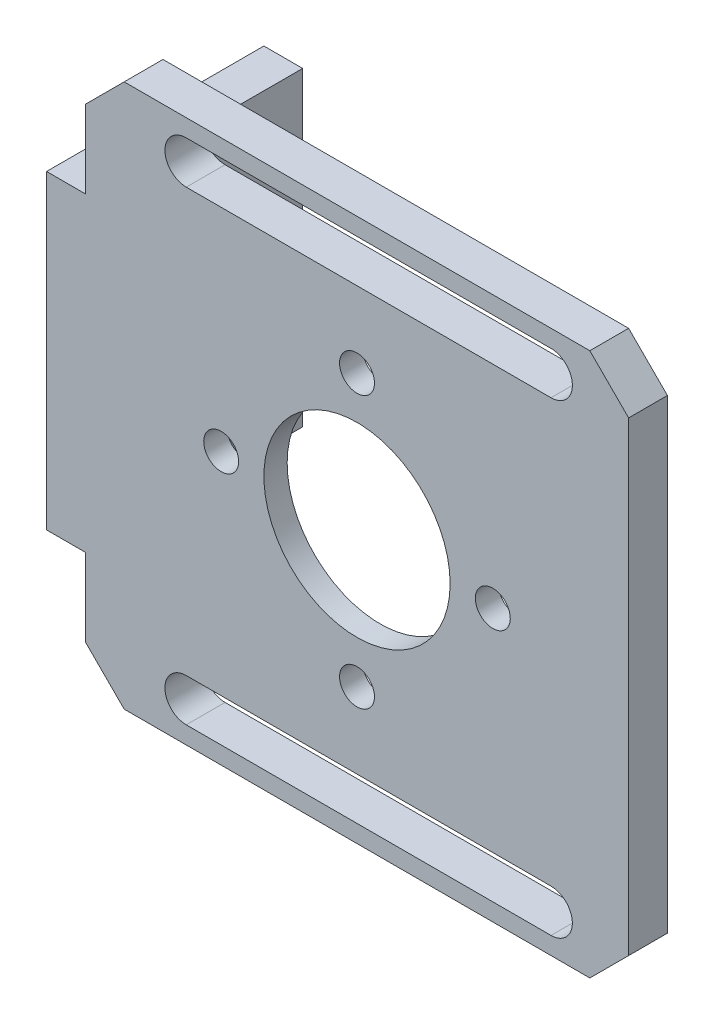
ISO-10303-21;
HEADER;
FILE_DESCRIPTION(('STEP AP214'),'2;1');
FILE_NAME('part.step','',(''),(''),'','','');
FILE_SCHEMA(('AUTOMOTIVE_DESIGN { 1 0 10303 214 1 1 1 1 }'));
ENDSEC;
DATA;
#1=APPLICATION_CONTEXT('core data for automotive mechanical design processes');
#2=APPLICATION_PROTOCOL_DEFINITION('international standard','automotive_design',2000,#1);
#3=PRODUCT_CONTEXT('',#1,'mechanical');
#4=PRODUCT('Part','Part','',(#3));
#5=PRODUCT_RELATED_PRODUCT_CATEGORY('part','',(#4));
#6=PRODUCT_DEFINITION_FORMATION('','',#4);
#7=PRODUCT_DEFINITION_CONTEXT('part definition',#1,'design');
#8=PRODUCT_DEFINITION('design','',#6,#7);
#9=PRODUCT_DEFINITION_SHAPE('','',#8);
#10=(LENGTH_UNIT() NAMED_UNIT(*) SI_UNIT(.MILLI.,.METRE.));
#11=(NAMED_UNIT(*) PLANE_ANGLE_UNIT() SI_UNIT($,.RADIAN.));
#12=(NAMED_UNIT(*) SI_UNIT($,.STERADIAN.) SOLID_ANGLE_UNIT());
#13=UNCERTAINTY_MEASURE_WITH_UNIT(LENGTH_MEASURE(1.E-05),#10,'distance_accuracy_value','');
#14=(GEOMETRIC_REPRESENTATION_CONTEXT(3) GLOBAL_UNCERTAINTY_ASSIGNED_CONTEXT((#13)) GLOBAL_UNIT_ASSIGNED_CONTEXT((#10,
#11,#12)) REPRESENTATION_CONTEXT('',''));
#15=CARTESIAN_POINT('',(0.,0.,0.));
#16=DIRECTION('',(0.,0.,1.));
#17=DIRECTION('',(1.,0.,0.));
#18=AXIS2_PLACEMENT_3D('',#15,#16,#17);
#19=CARTESIAN_POINT('',(0.,0.,-23.));
#20=DIRECTION('',(0.,0.,1.));
#21=DIRECTION('',(1.,0.,0.));
#22=AXIS2_PLACEMENT_3D('',#19,#20,#21);
#23=CYLINDRICAL_SURFACE('',#22,12.);
#24=CARTESIAN_POINT('',(0.,0.,5.));
#25=DIRECTION('',(0.,0.,1.));
#26=DIRECTION('',(1.,0.,0.));
#27=AXIS2_PLACEMENT_3D('',#24,#25,#26);
#28=CIRCLE('',#27,12.);
#29=CARTESIAN_POINT('',(12.,0.,5.));
#30=VERTEX_POINT('',#29);
#31=EDGE_CURVE('E221',#30,#30,#28,.T.);
#32=ORIENTED_EDGE('',*,*,#31,.T.);
#33=EDGE_LOOP('',(#32));
#34=FACE_BOUND('',#33,.T.);
#35=CARTESIAN_POINT('',(0.,0.,2.));
#36=DIRECTION('',(0.,0.,-1.));
#37=DIRECTION('',(-1.,0.,0.));
#38=AXIS2_PLACEMENT_3D('',#35,#36,#37);
#39=CIRCLE('',#38,12.);
#40=CARTESIAN_POINT('',(-12.,0.,2.));
#41=VERTEX_POINT('',#40);
#42=EDGE_CURVE('E218',#41,#41,#39,.F.);
#43=ORIENTED_EDGE('',*,*,#42,.F.);
#44=EDGE_LOOP('',(#43));
#45=FACE_BOUND('',#44,.T.);
#46=ADVANCED_FACE('F33',(#34,#45),#23,.F.);
#47=CARTESIAN_POINT('',(-35.,35.,5.));
#48=DIRECTION('',(1.,0.,0.));
#49=DIRECTION('',(0.,0.,-1.));
#50=AXIS2_PLACEMENT_3D('',#47,#48,#49);
#51=PLANE('',#50);
#52=DIRECTION('',(0.,0.,1.));
#53=VECTOR('',#52,1.);
#54=CARTESIAN_POINT('',(-35.,-20.,-23.));
#55=LINE('',#54,#53);
#56=CARTESIAN_POINT('',(-35.,-20.,0.));
#57=VERTEX_POINT('',#56);
#58=CARTESIAN_POINT('',(-35.,-20.,5.));
#59=VERTEX_POINT('',#58);
#60=EDGE_CURVE('E42',#57,#59,#55,.T.);
#61=ORIENTED_EDGE('',*,*,#60,.F.);
#62=DIRECTION('',(0.,-1.,0.));
#63=VECTOR('',#62,1.);
#64=CARTESIAN_POINT('',(-35.,35.,0.));
#65=LINE('',#64,#63);
#66=CARTESIAN_POINT('',(-35.,-30.,0.));
#67=VERTEX_POINT('',#66);
#68=EDGE_CURVE('E345',#57,#67,#65,.T.);
#69=ORIENTED_EDGE('',*,*,#68,.T.);
#70=DIRECTION('',(0.,0.,1.));
#71=VECTOR('',#70,1.);
#72=CARTESIAN_POINT('',(-35.,-30.,5.));
#73=LINE('',#72,#71);
#74=CARTESIAN_POINT('',(-35.,-30.,5.));
#75=VERTEX_POINT('',#74);
#76=EDGE_CURVE('E178',#67,#75,#73,.T.);
#77=ORIENTED_EDGE('',*,*,#76,.T.);
#78=DIRECTION('',(0.,-1.,0.));
#79=VECTOR('',#78,1.);
#80=CARTESIAN_POINT('',(-35.,35.,5.));
#81=LINE('',#80,#79);
#82=EDGE_CURVE('E175',#59,#75,#81,.T.);
#83=ORIENTED_EDGE('',*,*,#82,.F.);
#84=EDGE_LOOP('',(#61,#69,#77,#83));
#85=FACE_BOUND('',#84,.T.);
#86=ADVANCED_FACE('F176',(#85),#51,.F.);
#87=CARTESIAN_POINT('',(-35.,-35.,5.));
#88=DIRECTION('',(0.,0.,1.));
#89=DIRECTION('',(1.,0.,0.));
#90=AXIS2_PLACEMENT_3D('',#87,#88,#89);
#91=PLANE('',#90);
#92=CARTESIAN_POINT('',(-17.5,-1.83302876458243E-13,5.));
#93=DIRECTION('',(0.,0.,1.));
#94=DIRECTION('',(0.,-1.,0.));
#95=AXIS2_PLACEMENT_3D('',#92,#93,#94);
#96=CIRCLE('',#95,2.25);
#97=CARTESIAN_POINT('',(-17.5,-2.25000000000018,5.));
#98=VERTEX_POINT('',#97);
#99=EDGE_CURVE('E243',#98,#98,#96,.T.);
#100=ORIENTED_EDGE('',*,*,#99,.F.);
#101=EDGE_LOOP('',(#100));
#102=FACE_BOUND('',#101,.T.);
#103=CARTESIAN_POINT('',(-1.22201917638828E-13,17.5,5.));
#104=DIRECTION('',(0.,0.,1.));
#105=DIRECTION('',(-1.,0.,0.));
#106=AXIS2_PLACEMENT_3D('',#103,#104,#105);
#107=CIRCLE('',#106,2.25);
#108=CARTESIAN_POINT('',(-2.25000000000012,17.5,5.));
#109=VERTEX_POINT('',#108);
#110=EDGE_CURVE('E233',#109,#109,#107,.T.);
#111=ORIENTED_EDGE('',*,*,#110,.F.);
#112=EDGE_LOOP('',(#111));
#113=FACE_BOUND('',#112,.T.);
#114=CARTESIAN_POINT('',(17.5,0.,5.));
#115=DIRECTION('',(0.,0.,1.));
#116=DIRECTION('',(0.,1.,0.));
#117=AXIS2_PLACEMENT_3D('',#114,#115,#116);
#118=CIRCLE('',#117,2.25);
#119=CARTESIAN_POINT('',(17.5,2.25000000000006,5.));
#120=VERTEX_POINT('',#119);
#121=EDGE_CURVE('E230',#120,#120,#118,.T.);
#122=ORIENTED_EDGE('',*,*,#121,.F.);
#123=EDGE_LOOP('',(#122));
#124=FACE_BOUND('',#123,.T.);
#125=CARTESIAN_POINT('',(0.,-17.5,5.));
#126=DIRECTION('',(0.,0.,1.));
#127=DIRECTION('',(1.,0.,0.));
#128=AXIS2_PLACEMENT_3D('',#125,#126,#127);
#129=CIRCLE('',#128,2.25);
#130=CARTESIAN_POINT('',(2.25,-17.5,5.));
#131=VERTEX_POINT('',#130);
#132=EDGE_CURVE('E227',#131,#131,#129,.T.);
#133=ORIENTED_EDGE('',*,*,#132,.F.);
#134=EDGE_LOOP('',(#133));
#135=FACE_BOUND('',#134,.T.);
#136=ORIENTED_EDGE('',*,*,#31,.F.);
#137=EDGE_LOOP('',(#136));
#138=FACE_BOUND('',#137,.T.);
#139=DIRECTION('',(1.,0.,0.));
#140=VECTOR('',#139,1.);
#141=CARTESIAN_POINT('',(-22.,27.25,5.));
#142=LINE('',#141,#140);
#143=CARTESIAN_POINT('',(-22.,27.25,5.));
#144=VERTEX_POINT('',#143);
#145=CARTESIAN_POINT('',(25.,27.25,5.));
#146=VERTEX_POINT('',#145);
#147=EDGE_CURVE('E361',#144,#146,#142,.T.);
#148=ORIENTED_EDGE('',*,*,#147,.F.);
#149=CARTESIAN_POINT('',(-22.,30.,5.));
#150=DIRECTION('',(0.,0.,1.));
#151=DIRECTION('',(1.,0.,0.));
#152=AXIS2_PLACEMENT_3D('',#149,#150,#151);
#153=CIRCLE('',#152,2.75);
#154=CARTESIAN_POINT('',(-22.,32.75,5.));
#155=VERTEX_POINT('',#154);
#156=EDGE_CURVE('E363',#155,#144,#153,.T.);
#157=ORIENTED_EDGE('',*,*,#156,.F.);
#158=DIRECTION('',(-1.,0.,0.));
#159=VECTOR('',#158,1.);
#160=CARTESIAN_POINT('',(-22.,32.75,5.));
#161=LINE('',#160,#159);
#162=CARTESIAN_POINT('',(25.,32.75,5.));
#163=VERTEX_POINT('',#162);
#164=EDGE_CURVE('E356',#163,#155,#161,.T.);
#165=ORIENTED_EDGE('',*,*,#164,.F.);
#166=CARTESIAN_POINT('',(25.,30.,5.));
#167=DIRECTION('',(0.,0.,1.));
#168=DIRECTION('',(-1.,0.,0.));
#169=AXIS2_PLACEMENT_3D('',#166,#167,#168);
#170=CIRCLE('',#169,2.75);
#171=EDGE_CURVE('E358',#146,#163,#170,.T.);
#172=ORIENTED_EDGE('',*,*,#171,.F.);
#173=EDGE_LOOP('',(#148,#157,#165,#172));
#174=FACE_BOUND('',#173,.T.);
#175=DIRECTION('',(-1.,0.,0.));
#176=VECTOR('',#175,1.);
#177=CARTESIAN_POINT('',(-35.,35.,5.));
#178=LINE('',#177,#176);
#179=CARTESIAN_POINT('',(30.,35.,5.));
#180=VERTEX_POINT('',#179);
#181=CARTESIAN_POINT('',(-30.,35.,5.));
#182=VERTEX_POINT('',#181);
#183=EDGE_CURVE('E289',#180,#182,#178,.T.);
#184=ORIENTED_EDGE('',*,*,#183,.T.);
#185=DIRECTION('',(0.70710678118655,0.707106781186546,0.));
#186=VECTOR('',#185,1.);
#187=CARTESIAN_POINT('',(-67.5,-2.49999999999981,5.));
#188=LINE('',#187,#186);
#189=CARTESIAN_POINT('',(-35.,30.,5.));
#190=VERTEX_POINT('',#189);
#191=EDGE_CURVE('E315',#182,#190,#188,.F.);
#192=ORIENTED_EDGE('',*,*,#191,.T.);
#193=CARTESIAN_POINT('',(-35.,20.,5.));
#194=VERTEX_POINT('',#193);
#195=EDGE_CURVE('E182',#190,#194,#81,.T.);
#196=ORIENTED_EDGE('',*,*,#195,.T.);
#197=DIRECTION('',(1.,0.,0.));
#198=VECTOR('',#197,1.);
#199=CARTESIAN_POINT('',(-35.,20.,5.));
#200=LINE('',#199,#198);
#201=CARTESIAN_POINT('',(-40.,20.,5.));
#202=VERTEX_POINT('',#201);
#203=EDGE_CURVE('E204',#202,#194,#200,.T.);
#204=ORIENTED_EDGE('',*,*,#203,.F.);
#205=DIRECTION('',(0.,1.,0.));
#206=VECTOR('',#205,1.);
#207=CARTESIAN_POINT('',(-40.,-20.,5.));
#208=LINE('',#207,#206);
#209=CARTESIAN_POINT('',(-40.,-20.,5.));
#210=VERTEX_POINT('',#209);
#211=EDGE_CURVE('E201',#210,#202,#208,.T.);
#212=ORIENTED_EDGE('',*,*,#211,.F.);
#213=DIRECTION('',(-1.,0.,0.));
#214=VECTOR('',#213,1.);
#215=CARTESIAN_POINT('',(-35.,-20.,5.));
#216=LINE('',#215,#214);
#217=EDGE_CURVE('E190',#59,#210,#216,.T.);
#218=ORIENTED_EDGE('',*,*,#217,.F.);
#219=ORIENTED_EDGE('',*,*,#82,.T.);
#220=DIRECTION('',(-0.707106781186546,0.70710678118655,0.));
#221=VECTOR('',#220,1.);
#222=CARTESIAN_POINT('',(-32.5,-32.5,5.));
#223=LINE('',#222,#221);
#224=CARTESIAN_POINT('',(-30.,-35.,5.));
#225=VERTEX_POINT('',#224);
#226=EDGE_CURVE('E313',#75,#225,#223,.F.);
#227=ORIENTED_EDGE('',*,*,#226,.T.);
#228=DIRECTION('',(1.,0.,0.));
#229=VECTOR('',#228,1.);
#230=CARTESIAN_POINT('',(-35.,-35.,5.));
#231=LINE('',#230,#229);
#232=CARTESIAN_POINT('',(30.,-35.,5.));
#233=VERTEX_POINT('',#232);
#234=EDGE_CURVE('E282',#225,#233,#231,.T.);
#235=ORIENTED_EDGE('',*,*,#234,.T.);
#236=DIRECTION('',(-0.707106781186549,-0.707106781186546,0.));
#237=VECTOR('',#236,1.);
#238=CARTESIAN_POINT('',(-2.50000000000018,-67.5,5.));
#239=LINE('',#238,#237);
#240=CARTESIAN_POINT('',(35.,-30.,5.));
#241=VERTEX_POINT('',#240);
#242=EDGE_CURVE('E311',#233,#241,#239,.F.);
#243=ORIENTED_EDGE('',*,*,#242,.T.);
#244=DIRECTION('',(0.,1.,0.));
#245=VECTOR('',#244,1.);
#246=CARTESIAN_POINT('',(35.,35.,5.));
#247=LINE('',#246,#245);
#248=CARTESIAN_POINT('',(35.,30.,5.));
#249=VERTEX_POINT('',#248);
#250=EDGE_CURVE('E286',#241,#249,#247,.T.);
#251=ORIENTED_EDGE('',*,*,#250,.T.);
#252=DIRECTION('',(0.707106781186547,-0.707106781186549,0.));
#253=VECTOR('',#252,1.);
#254=CARTESIAN_POINT('',(32.5000000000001,32.4999999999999,5.));
#255=LINE('',#254,#253);
#256=EDGE_CURVE('E309',#249,#180,#255,.F.);
#257=ORIENTED_EDGE('',*,*,#256,.T.);
#258=EDGE_LOOP('',(#184,#192,#196,#204,#212,#218,#219,#227,#235,#243,#251,#257));
#259=FACE_BOUND('',#258,.T.);
#260=DIRECTION('',(-1.,0.,0.));
#261=VECTOR('',#260,1.);
#262=CARTESIAN_POINT('',(-22.,-27.25,5.));
#263=LINE('',#262,#261);
#264=CARTESIAN_POINT('',(25.,-27.25,5.));
#265=VERTEX_POINT('',#264);
#266=CARTESIAN_POINT('',(-22.,-27.25,5.));
#267=VERTEX_POINT('',#266);
#268=EDGE_CURVE('E392',#265,#267,#263,.T.);
#269=ORIENTED_EDGE('',*,*,#268,.F.);
#270=CARTESIAN_POINT('',(25.,-30.,5.));
#271=DIRECTION('',(0.,0.,1.));
#272=DIRECTION('',(1.,0.,0.));
#273=AXIS2_PLACEMENT_3D('',#270,#271,#272);
#274=CIRCLE('',#273,2.75);
#275=CARTESIAN_POINT('',(25.,-32.75,5.));
#276=VERTEX_POINT('',#275);
#277=EDGE_CURVE('E394',#276,#265,#274,.T.);
#278=ORIENTED_EDGE('',*,*,#277,.F.);
#279=DIRECTION('',(1.,0.,0.));
#280=VECTOR('',#279,1.);
#281=CARTESIAN_POINT('',(-22.,-32.75,5.));
#282=LINE('',#281,#280);
#283=CARTESIAN_POINT('',(-22.,-32.75,5.));
#284=VERTEX_POINT('',#283);
#285=EDGE_CURVE('E387',#284,#276,#282,.T.);
#286=ORIENTED_EDGE('',*,*,#285,.F.);
#287=CARTESIAN_POINT('',(-22.,-30.,5.));
#288=DIRECTION('',(0.,0.,1.));
#289=DIRECTION('',(-1.,0.,0.));
#290=AXIS2_PLACEMENT_3D('',#287,#288,#289);
#291=CIRCLE('',#290,2.75);
#292=EDGE_CURVE('E389',#267,#284,#291,.T.);
#293=ORIENTED_EDGE('',*,*,#292,.F.);
#294=EDGE_LOOP('',(#269,#278,#286,#293));
#295=FACE_BOUND('',#294,.T.);
#296=ADVANCED_FACE('F197',(#102,#113,#124,#135,#138,#174,#259,#295),#91,.T.);
#297=CARTESIAN_POINT('',(-35.,-35.,0.));
#298=DIRECTION('',(0.,0.,1.));
#299=DIRECTION('',(1.,0.,0.));
#300=AXIS2_PLACEMENT_3D('',#297,#298,#299);
#301=PLANE('',#300);
#302=CARTESIAN_POINT('',(0.,0.,0.));
#303=DIRECTION('',(0.,0.,-1.));
#304=DIRECTION('',(-1.,0.,0.));
#305=AXIS2_PLACEMENT_3D('',#302,#303,#304);
#306=CIRCLE('',#305,23.5);
#307=CARTESIAN_POINT('',(-23.5,0.,0.));
#308=VERTEX_POINT('',#307);
#309=EDGE_CURVE('E226',#308,#308,#306,.T.);
#310=ORIENTED_EDGE('',*,*,#309,.F.);
#311=EDGE_LOOP('',(#310));
#312=FACE_BOUND('',#311,.T.);
#313=CARTESIAN_POINT('',(-22.,30.,0.));
#314=DIRECTION('',(0.,0.,1.));
#315=DIRECTION('',(1.,0.,0.));
#316=AXIS2_PLACEMENT_3D('',#313,#314,#315);
#317=CIRCLE('',#316,2.75);
#318=CARTESIAN_POINT('',(-22.,32.75,0.));
#319=VERTEX_POINT('',#318);
#320=CARTESIAN_POINT('',(-22.,27.25,0.));
#321=VERTEX_POINT('',#320);
#322=EDGE_CURVE('E374',#319,#321,#317,.T.);
#323=ORIENTED_EDGE('',*,*,#322,.T.);
#324=DIRECTION('',(1.,0.,0.));
#325=VECTOR('',#324,1.);
#326=CARTESIAN_POINT('',(-22.,27.25,0.));
#327=LINE('',#326,#325);
#328=CARTESIAN_POINT('',(25.,27.25,0.));
#329=VERTEX_POINT('',#328);
#330=EDGE_CURVE('E371',#321,#329,#327,.T.);
#331=ORIENTED_EDGE('',*,*,#330,.T.);
#332=CARTESIAN_POINT('',(25.,30.,0.));
#333=DIRECTION('',(0.,0.,1.));
#334=DIRECTION('',(-1.,0.,0.));
#335=AXIS2_PLACEMENT_3D('',#332,#333,#334);
#336=CIRCLE('',#335,2.75);
#337=CARTESIAN_POINT('',(25.,32.75,0.));
#338=VERTEX_POINT('',#337);
#339=EDGE_CURVE('E368',#329,#338,#336,.T.);
#340=ORIENTED_EDGE('',*,*,#339,.T.);
#341=DIRECTION('',(-1.,0.,0.));
#342=VECTOR('',#341,1.);
#343=CARTESIAN_POINT('',(-22.,32.75,0.));
#344=LINE('',#343,#342);
#345=EDGE_CURVE('E365',#338,#319,#344,.T.);
#346=ORIENTED_EDGE('',*,*,#345,.T.);
#347=EDGE_LOOP('',(#323,#331,#340,#346));
#348=FACE_BOUND('',#347,.T.);
#349=CARTESIAN_POINT('',(-35.,30.,0.));
#350=VERTEX_POINT('',#349);
#351=CARTESIAN_POINT('',(-35.,20.,0.));
#352=VERTEX_POINT('',#351);
#353=EDGE_CURVE('E341',#350,#352,#65,.T.);
#354=ORIENTED_EDGE('',*,*,#353,.F.);
#355=DIRECTION('',(-0.70710678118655,-0.707106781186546,0.));
#356=VECTOR('',#355,1.);
#357=CARTESIAN_POINT('',(-35.,30.,0.));
#358=LINE('',#357,#356);
#359=CARTESIAN_POINT('',(-30.,35.,0.));
#360=VERTEX_POINT('',#359);
#361=EDGE_CURVE('E302',#350,#360,#358,.F.);
#362=ORIENTED_EDGE('',*,*,#361,.T.);
#363=DIRECTION('',(-1.,0.,0.));
#364=VECTOR('',#363,1.);
#365=CARTESIAN_POINT('',(-35.,35.,0.));
#366=LINE('',#365,#364);
#367=CARTESIAN_POINT('',(30.,35.,0.));
#368=VERTEX_POINT('',#367);
#369=EDGE_CURVE('E183',#368,#360,#366,.T.);
#370=ORIENTED_EDGE('',*,*,#369,.F.);
#371=DIRECTION('',(-0.707106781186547,0.707106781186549,0.));
#372=VECTOR('',#371,1.);
#373=CARTESIAN_POINT('',(30.,35.,0.));
#374=LINE('',#373,#372);
#375=CARTESIAN_POINT('',(35.,30.,0.));
#376=VERTEX_POINT('',#375);
#377=EDGE_CURVE('E295',#368,#376,#374,.F.);
#378=ORIENTED_EDGE('',*,*,#377,.T.);
#379=DIRECTION('',(0.,1.,0.));
#380=VECTOR('',#379,1.);
#381=CARTESIAN_POINT('',(35.,35.,0.));
#382=LINE('',#381,#380);
#383=CARTESIAN_POINT('',(35.,-30.,0.));
#384=VERTEX_POINT('',#383);
#385=EDGE_CURVE('E330',#384,#376,#382,.T.);
#386=ORIENTED_EDGE('',*,*,#385,.F.);
#387=DIRECTION('',(0.707106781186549,0.707106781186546,0.));
#388=VECTOR('',#387,1.);
#389=CARTESIAN_POINT('',(35.,-30.,0.));
#390=LINE('',#389,#388);
#391=CARTESIAN_POINT('',(30.,-35.,0.));
#392=VERTEX_POINT('',#391);
#393=EDGE_CURVE('E297',#384,#392,#390,.F.);
#394=ORIENTED_EDGE('',*,*,#393,.T.);
#395=DIRECTION('',(1.,0.,0.));
#396=VECTOR('',#395,1.);
#397=CARTESIAN_POINT('',(-35.,-35.,0.));
#398=LINE('',#397,#396);
#399=CARTESIAN_POINT('',(-30.,-35.,0.));
#400=VERTEX_POINT('',#399);
#401=EDGE_CURVE('E339',#400,#392,#398,.T.);
#402=ORIENTED_EDGE('',*,*,#401,.F.);
#403=DIRECTION('',(0.707106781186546,-0.70710678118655,0.));
#404=VECTOR('',#403,1.);
#405=CARTESIAN_POINT('',(-30.,-35.,0.));
#406=LINE('',#405,#404);
#407=EDGE_CURVE('E299',#400,#67,#406,.F.);
#408=ORIENTED_EDGE('',*,*,#407,.T.);
#409=ORIENTED_EDGE('',*,*,#68,.F.);
#410=EDGE_CURVE('E56',#352,#57,#65,.T.);
#411=ORIENTED_EDGE('',*,*,#410,.F.);
#412=EDGE_LOOP('',(#354,#362,#370,#378,#386,#394,#402,#408,#409,#411));
#413=FACE_BOUND('',#412,.T.);
#414=CARTESIAN_POINT('',(25.,-30.,0.));
#415=DIRECTION('',(0.,0.,1.));
#416=DIRECTION('',(1.,0.,0.));
#417=AXIS2_PLACEMENT_3D('',#414,#415,#416);
#418=CIRCLE('',#417,2.75);
#419=CARTESIAN_POINT('',(25.,-32.75,0.));
#420=VERTEX_POINT('',#419);
#421=CARTESIAN_POINT('',(25.,-27.25,0.));
#422=VERTEX_POINT('',#421);
#423=EDGE_CURVE('E273',#420,#422,#418,.T.);
#424=ORIENTED_EDGE('',*,*,#423,.T.);
#425=DIRECTION('',(-1.,0.,0.));
#426=VECTOR('',#425,1.);
#427=CARTESIAN_POINT('',(-22.,-27.25,0.));
#428=LINE('',#427,#426);
#429=CARTESIAN_POINT('',(-22.,-27.25,0.));
#430=VERTEX_POINT('',#429);
#431=EDGE_CURVE('E401',#422,#430,#428,.T.);
#432=ORIENTED_EDGE('',*,*,#431,.T.);
#433=CARTESIAN_POINT('',(-22.,-30.,0.));
#434=DIRECTION('',(0.,0.,1.));
#435=DIRECTION('',(-1.,0.,0.));
#436=AXIS2_PLACEMENT_3D('',#433,#434,#435);
#437=CIRCLE('',#436,2.75);
#438=CARTESIAN_POINT('',(-22.,-32.75,0.));
#439=VERTEX_POINT('',#438);
#440=EDGE_CURVE('E399',#430,#439,#437,.T.);
#441=ORIENTED_EDGE('',*,*,#440,.T.);
#442=DIRECTION('',(1.,0.,0.));
#443=VECTOR('',#442,1.);
#444=CARTESIAN_POINT('',(-22.,-32.75,0.));
#445=LINE('',#444,#443);
#446=EDGE_CURVE('E396',#439,#420,#445,.T.);
#447=ORIENTED_EDGE('',*,*,#446,.T.);
#448=EDGE_LOOP('',(#424,#432,#441,#447));
#449=FACE_BOUND('',#448,.T.);
#450=ADVANCED_FACE('F334',(#312,#348,#413,#449),#301,.F.);
#451=ORIENTED_EDGE('',*,*,#353,.T.);
#452=DIRECTION('',(0.,0.,1.));
#453=VECTOR('',#452,1.);
#454=CARTESIAN_POINT('',(-35.,20.,-23.));
#455=LINE('',#454,#453);
#456=EDGE_CURVE('E11',#352,#194,#455,.T.);
#457=ORIENTED_EDGE('',*,*,#456,.T.);
#458=ORIENTED_EDGE('',*,*,#195,.F.);
#459=DIRECTION('',(0.,0.,-1.));
#460=VECTOR('',#459,1.);
#461=CARTESIAN_POINT('',(-35.,30.,5.));
#462=LINE('',#461,#460);
#463=EDGE_CURVE('E292',#190,#350,#462,.T.);
#464=ORIENTED_EDGE('',*,*,#463,.T.);
#465=EDGE_LOOP('',(#451,#457,#458,#464));
#466=FACE_BOUND('',#465,.T.);
#467=ADVANCED_FACE('F35',(#466),#51,.F.);
#468=CARTESIAN_POINT('',(-35.,-35.,5.));
#469=DIRECTION('',(0.,1.,0.));
#470=DIRECTION('',(0.,0.,1.));
#471=AXIS2_PLACEMENT_3D('',#468,#469,#470);
#472=PLANE('',#471);
#473=ORIENTED_EDGE('',*,*,#234,.F.);
#474=DIRECTION('',(0.,0.,-1.));
#475=VECTOR('',#474,1.);
#476=CARTESIAN_POINT('',(-30.,-35.,5.));
#477=LINE('',#476,#475);
#478=EDGE_CURVE('E319',#225,#400,#477,.T.);
#479=ORIENTED_EDGE('',*,*,#478,.T.);
#480=ORIENTED_EDGE('',*,*,#401,.T.);
#481=DIRECTION('',(0.,0.,1.));
#482=VECTOR('',#481,1.);
#483=CARTESIAN_POINT('',(30.,-35.,5.));
#484=LINE('',#483,#482);
#485=EDGE_CURVE('E317',#392,#233,#484,.T.);
#486=ORIENTED_EDGE('',*,*,#485,.T.);
#487=EDGE_LOOP('',(#473,#479,#480,#486));
#488=FACE_BOUND('',#487,.T.);
#489=ADVANCED_FACE('F497',(#488),#472,.F.);
#490=CARTESIAN_POINT('',(35.,35.,5.));
#491=DIRECTION('',(-1.,0.,0.));
#492=DIRECTION('',(0.,-1.,0.));
#493=AXIS2_PLACEMENT_3D('',#490,#491,#492);
#494=PLANE('',#493);
#495=ORIENTED_EDGE('',*,*,#250,.F.);
#496=DIRECTION('',(0.,0.,-1.));
#497=VECTOR('',#496,1.);
#498=CARTESIAN_POINT('',(35.,-30.,5.));
#499=LINE('',#498,#497);
#500=EDGE_CURVE('E193',#241,#384,#499,.T.);
#501=ORIENTED_EDGE('',*,*,#500,.T.);
#502=ORIENTED_EDGE('',*,*,#385,.T.);
#503=DIRECTION('',(0.,0.,1.));
#504=VECTOR('',#503,1.);
#505=CARTESIAN_POINT('',(35.,30.,5.));
#506=LINE('',#505,#504);
#507=EDGE_CURVE('E322',#376,#249,#506,.T.);
#508=ORIENTED_EDGE('',*,*,#507,.T.);
#509=EDGE_LOOP('',(#495,#501,#502,#508));
#510=FACE_BOUND('',#509,.T.);
#511=ADVANCED_FACE('F329',(#510),#494,.F.);
#512=CARTESIAN_POINT('',(-35.,35.,5.));
#513=DIRECTION('',(0.,-1.,0.));
#514=DIRECTION('',(0.,0.,-1.));
#515=AXIS2_PLACEMENT_3D('',#512,#513,#514);
#516=PLANE('',#515);
#517=ORIENTED_EDGE('',*,*,#369,.T.);
#518=DIRECTION('',(0.,0.,1.));
#519=VECTOR('',#518,1.);
#520=CARTESIAN_POINT('',(-30.,35.,5.));
#521=LINE('',#520,#519);
#522=EDGE_CURVE('E307',#360,#182,#521,.T.);
#523=ORIENTED_EDGE('',*,*,#522,.T.);
#524=ORIENTED_EDGE('',*,*,#183,.F.);
#525=DIRECTION('',(0.,0.,-1.));
#526=VECTOR('',#525,1.);
#527=CARTESIAN_POINT('',(30.,35.,5.));
#528=LINE('',#527,#526);
#529=EDGE_CURVE('E304',#180,#368,#528,.T.);
#530=ORIENTED_EDGE('',*,*,#529,.T.);
#531=EDGE_LOOP('',(#517,#523,#524,#530));
#532=FACE_BOUND('',#531,.T.);
#533=ADVANCED_FACE('F502',(#532),#516,.F.);
#534=CARTESIAN_POINT('',(-22.,30.,5.));
#535=DIRECTION('',(0.,0.,-1.));
#536=DIRECTION('',(-1.,0.,0.));
#537=AXIS2_PLACEMENT_3D('',#534,#535,#536);
#538=CYLINDRICAL_SURFACE('',#537,2.75);
#539=ORIENTED_EDGE('',*,*,#322,.F.);
#540=DIRECTION('',(0.,0.,-1.));
#541=VECTOR('',#540,1.);
#542=CARTESIAN_POINT('',(-22.,32.75,5.));
#543=LINE('',#542,#541);
#544=EDGE_CURVE('E353',#155,#319,#543,.T.);
#545=ORIENTED_EDGE('',*,*,#544,.F.);
#546=ORIENTED_EDGE('',*,*,#156,.T.);
#547=DIRECTION('',(0.,0.,-1.));
#548=VECTOR('',#547,1.);
#549=CARTESIAN_POINT('',(-22.,27.25,5.));
#550=LINE('',#549,#548);
#551=EDGE_CURVE('E346',#144,#321,#550,.T.);
#552=ORIENTED_EDGE('',*,*,#551,.T.);
#553=EDGE_LOOP('',(#539,#545,#546,#552));
#554=FACE_BOUND('',#553,.T.);
#555=ADVANCED_FACE('F504',(#554),#538,.F.);
#556=CARTESIAN_POINT('',(-22.,27.25,5.));
#557=DIRECTION('',(0.,1.,0.));
#558=DIRECTION('',(0.,0.,1.));
#559=AXIS2_PLACEMENT_3D('',#556,#557,#558);
#560=PLANE('',#559);
#561=ORIENTED_EDGE('',*,*,#330,.F.);
#562=ORIENTED_EDGE('',*,*,#551,.F.);
#563=ORIENTED_EDGE('',*,*,#147,.T.);
#564=DIRECTION('',(0.,0.,-1.));
#565=VECTOR('',#564,1.);
#566=CARTESIAN_POINT('',(25.,27.25,5.));
#567=LINE('',#566,#565);
#568=EDGE_CURVE('E349',#146,#329,#567,.T.);
#569=ORIENTED_EDGE('',*,*,#568,.T.);
#570=EDGE_LOOP('',(#561,#562,#563,#569));
#571=FACE_BOUND('',#570,.T.);
#572=ADVANCED_FACE('F510',(#571),#560,.T.);
#573=CARTESIAN_POINT('',(25.,30.,5.));
#574=DIRECTION('',(0.,0.,-1.));
#575=DIRECTION('',(-1.,0.,0.));
#576=AXIS2_PLACEMENT_3D('',#573,#574,#575);
#577=CYLINDRICAL_SURFACE('',#576,2.75);
#578=ORIENTED_EDGE('',*,*,#339,.F.);
#579=ORIENTED_EDGE('',*,*,#568,.F.);
#580=ORIENTED_EDGE('',*,*,#171,.T.);
#581=DIRECTION('',(0.,0.,-1.));
#582=VECTOR('',#581,1.);
#583=CARTESIAN_POINT('',(25.,32.75,5.));
#584=LINE('',#583,#582);
#585=EDGE_CURVE('E351',#163,#338,#584,.T.);
#586=ORIENTED_EDGE('',*,*,#585,.T.);
#587=EDGE_LOOP('',(#578,#579,#580,#586));
#588=FACE_BOUND('',#587,.T.);
#589=ADVANCED_FACE('F533',(#588),#577,.F.);
#590=CARTESIAN_POINT('',(-22.,32.75,5.));
#591=DIRECTION('',(0.,-1.,0.));
#592=DIRECTION('',(0.,0.,-1.));
#593=AXIS2_PLACEMENT_3D('',#590,#591,#592);
#594=PLANE('',#593);
#595=ORIENTED_EDGE('',*,*,#345,.F.);
#596=ORIENTED_EDGE('',*,*,#585,.F.);
#597=ORIENTED_EDGE('',*,*,#164,.T.);
#598=ORIENTED_EDGE('',*,*,#544,.T.);
#599=EDGE_LOOP('',(#595,#596,#597,#598));
#600=FACE_BOUND('',#599,.T.);
#601=ADVANCED_FACE('F537',(#600),#594,.T.);
#602=CARTESIAN_POINT('',(25.,-30.,5.));
#603=DIRECTION('',(0.,0.,-1.));
#604=DIRECTION('',(-1.,0.,0.));
#605=AXIS2_PLACEMENT_3D('',#602,#603,#604);
#606=CYLINDRICAL_SURFACE('',#605,2.75);
#607=ORIENTED_EDGE('',*,*,#423,.F.);
#608=DIRECTION('',(0.,0.,-1.));
#609=VECTOR('',#608,1.);
#610=CARTESIAN_POINT('',(25.,-32.75,5.));
#611=LINE('',#610,#609);
#612=EDGE_CURVE('E384',#276,#420,#611,.T.);
#613=ORIENTED_EDGE('',*,*,#612,.F.);
#614=ORIENTED_EDGE('',*,*,#277,.T.);
#615=DIRECTION('',(0.,0.,-1.));
#616=VECTOR('',#615,1.);
#617=CARTESIAN_POINT('',(25.,-27.25,5.));
#618=LINE('',#617,#616);
#619=EDGE_CURVE('E377',#265,#422,#618,.T.);
#620=ORIENTED_EDGE('',*,*,#619,.T.);
#621=EDGE_LOOP('',(#607,#613,#614,#620));
#622=FACE_BOUND('',#621,.T.);
#623=ADVANCED_FACE('F407',(#622),#606,.F.);
#624=CARTESIAN_POINT('',(-22.,-27.25,5.));
#625=DIRECTION('',(0.,-1.,0.));
#626=DIRECTION('',(1.,0.,0.));
#627=AXIS2_PLACEMENT_3D('',#624,#625,#626);
#628=PLANE('',#627);
#629=ORIENTED_EDGE('',*,*,#431,.F.);
#630=ORIENTED_EDGE('',*,*,#619,.F.);
#631=ORIENTED_EDGE('',*,*,#268,.T.);
#632=DIRECTION('',(0.,0.,-1.));
#633=VECTOR('',#632,1.);
#634=CARTESIAN_POINT('',(-22.,-27.25,5.));
#635=LINE('',#634,#633);
#636=EDGE_CURVE('E380',#267,#430,#635,.T.);
#637=ORIENTED_EDGE('',*,*,#636,.T.);
#638=EDGE_LOOP('',(#629,#630,#631,#637));
#639=FACE_BOUND('',#638,.T.);
#640=ADVANCED_FACE('F416',(#639),#628,.T.);
#641=CARTESIAN_POINT('',(-22.,-30.,5.));
#642=DIRECTION('',(0.,0.,-1.));
#643=DIRECTION('',(-1.,0.,0.));
#644=AXIS2_PLACEMENT_3D('',#641,#642,#643);
#645=CYLINDRICAL_SURFACE('',#644,2.75);
#646=ORIENTED_EDGE('',*,*,#440,.F.);
#647=ORIENTED_EDGE('',*,*,#636,.F.);
#648=ORIENTED_EDGE('',*,*,#292,.T.);
#649=DIRECTION('',(0.,0.,-1.));
#650=VECTOR('',#649,1.);
#651=CARTESIAN_POINT('',(-22.,-32.75,5.));
#652=LINE('',#651,#650);
#653=EDGE_CURVE('E382',#284,#439,#652,.T.);
#654=ORIENTED_EDGE('',*,*,#653,.T.);
#655=EDGE_LOOP('',(#646,#647,#648,#654));
#656=FACE_BOUND('',#655,.T.);
#657=ADVANCED_FACE('F420',(#656),#645,.F.);
#658=CARTESIAN_POINT('',(-22.,-32.75,5.));
#659=DIRECTION('',(0.,1.,0.));
#660=DIRECTION('',(-1.,0.,0.));
#661=AXIS2_PLACEMENT_3D('',#658,#659,#660);
#662=PLANE('',#661);
#663=ORIENTED_EDGE('',*,*,#446,.F.);
#664=ORIENTED_EDGE('',*,*,#653,.F.);
#665=ORIENTED_EDGE('',*,*,#285,.T.);
#666=ORIENTED_EDGE('',*,*,#612,.T.);
#667=EDGE_LOOP('',(#663,#664,#665,#666));
#668=FACE_BOUND('',#667,.T.);
#669=ADVANCED_FACE('F411',(#668),#662,.T.);
#670=CARTESIAN_POINT('',(-35.,30.,5.));
#671=DIRECTION('',(0.707106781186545,-0.707106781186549,0.));
#672=DIRECTION('',(0.70710678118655,0.707106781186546,0.));
#673=AXIS2_PLACEMENT_3D('',#670,#671,#672);
#674=PLANE('',#673);
#675=ORIENTED_EDGE('',*,*,#191,.F.);
#676=ORIENTED_EDGE('',*,*,#522,.F.);
#677=ORIENTED_EDGE('',*,*,#361,.F.);
#678=ORIENTED_EDGE('',*,*,#463,.F.);
#679=EDGE_LOOP('',(#675,#676,#677,#678));
#680=FACE_BOUND('',#679,.T.);
#681=ADVANCED_FACE('F427',(#680),#674,.F.);
#682=CARTESIAN_POINT('',(-30.,-35.,5.));
#683=DIRECTION('',(0.707106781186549,0.707106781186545,0.));
#684=DIRECTION('',(-0.707106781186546,0.70710678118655,0.));
#685=AXIS2_PLACEMENT_3D('',#682,#683,#684);
#686=PLANE('',#685);
#687=ORIENTED_EDGE('',*,*,#226,.F.);
#688=ORIENTED_EDGE('',*,*,#76,.F.);
#689=ORIENTED_EDGE('',*,*,#407,.F.);
#690=ORIENTED_EDGE('',*,*,#478,.F.);
#691=EDGE_LOOP('',(#687,#688,#689,#690));
#692=FACE_BOUND('',#691,.T.);
#693=ADVANCED_FACE('F471',(#692),#686,.F.);
#694=CARTESIAN_POINT('',(35.,-30.,5.));
#695=DIRECTION('',(-0.707106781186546,0.707106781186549,0.));
#696=DIRECTION('',(-0.707106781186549,-0.707106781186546,0.));
#697=AXIS2_PLACEMENT_3D('',#694,#695,#696);
#698=PLANE('',#697);
#699=ORIENTED_EDGE('',*,*,#242,.F.);
#700=ORIENTED_EDGE('',*,*,#485,.F.);
#701=ORIENTED_EDGE('',*,*,#393,.F.);
#702=ORIENTED_EDGE('',*,*,#500,.F.);
#703=EDGE_LOOP('',(#699,#700,#701,#702));
#704=FACE_BOUND('',#703,.T.);
#705=ADVANCED_FACE('F467',(#704),#698,.F.);
#706=CARTESIAN_POINT('',(30.,35.,5.));
#707=DIRECTION('',(-0.707106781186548,-0.707106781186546,0.));
#708=DIRECTION('',(0.707106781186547,-0.707106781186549,0.));
#709=AXIS2_PLACEMENT_3D('',#706,#707,#708);
#710=PLANE('',#709);
#711=ORIENTED_EDGE('',*,*,#256,.F.);
#712=ORIENTED_EDGE('',*,*,#507,.F.);
#713=ORIENTED_EDGE('',*,*,#377,.F.);
#714=ORIENTED_EDGE('',*,*,#529,.F.);
#715=EDGE_LOOP('',(#711,#712,#713,#714));
#716=FACE_BOUND('',#715,.T.);
#717=ADVANCED_FACE('F463',(#716),#710,.F.);
#718=CARTESIAN_POINT('',(-35.,-20.,-23.));
#719=DIRECTION('',(-1.,0.,0.));
#720=DIRECTION('',(0.,0.,1.));
#721=AXIS2_PLACEMENT_3D('',#718,#719,#720);
#722=PLANE('',#721);
#723=CARTESIAN_POINT('',(-35.,0.,-14.));
#724=DIRECTION('',(1.,0.,0.));
#725=DIRECTION('',(0.,0.,-1.));
#726=AXIS2_PLACEMENT_3D('',#723,#724,#725);
#727=CIRCLE('',#726,3.25);
#728=CARTESIAN_POINT('',(-35.,0.,-17.25));
#729=VERTEX_POINT('',#728);
#730=EDGE_CURVE('E207',#729,#729,#727,.T.);
#731=ORIENTED_EDGE('',*,*,#730,.F.);
#732=EDGE_LOOP('',(#731));
#733=FACE_BOUND('',#732,.T.);
#734=CARTESIAN_POINT('',(-35.,20.,-23.));
#735=VERTEX_POINT('',#734);
#736=EDGE_CURVE('E263',#735,#352,#455,.T.);
#737=ORIENTED_EDGE('',*,*,#736,.T.);
#738=ORIENTED_EDGE('',*,*,#410,.T.);
#739=CARTESIAN_POINT('',(-35.,-20.,-23.));
#740=VERTEX_POINT('',#739);
#741=EDGE_CURVE('E192',#740,#57,#55,.T.);
#742=ORIENTED_EDGE('',*,*,#741,.F.);
#743=DIRECTION('',(0.,-1.,0.));
#744=VECTOR('',#743,1.);
#745=CARTESIAN_POINT('',(-35.,-20.,-23.));
#746=LINE('',#745,#744);
#747=EDGE_CURVE('E215',#735,#740,#746,.T.);
#748=ORIENTED_EDGE('',*,*,#747,.F.);
#749=EDGE_LOOP('',(#737,#738,#742,#748));
#750=FACE_BOUND('',#749,.T.);
#751=ADVANCED_FACE('F460',(#733,#750),#722,.F.);
#752=CARTESIAN_POINT('',(-35.,-20.,-23.));
#753=DIRECTION('',(0.,1.,0.));
#754=DIRECTION('',(-1.,0.,0.));
#755=AXIS2_PLACEMENT_3D('',#752,#753,#754);
#756=PLANE('',#755);
#757=ORIENTED_EDGE('',*,*,#741,.T.);
#758=ORIENTED_EDGE('',*,*,#60,.T.);
#759=ORIENTED_EDGE('',*,*,#217,.T.);
#760=DIRECTION('',(0.,0.,1.));
#761=VECTOR('',#760,1.);
#762=CARTESIAN_POINT('',(-40.,-20.,-23.));
#763=LINE('',#762,#761);
#764=CARTESIAN_POINT('',(-40.,-20.,-23.));
#765=VERTEX_POINT('',#764);
#766=EDGE_CURVE('E269',#765,#210,#763,.T.);
#767=ORIENTED_EDGE('',*,*,#766,.F.);
#768=DIRECTION('',(-1.,0.,0.));
#769=VECTOR('',#768,1.);
#770=CARTESIAN_POINT('',(-35.,-20.,-23.));
#771=LINE('',#770,#769);
#772=EDGE_CURVE('E258',#740,#765,#771,.T.);
#773=ORIENTED_EDGE('',*,*,#772,.F.);
#774=EDGE_LOOP('',(#757,#758,#759,#767,#773));
#775=FACE_BOUND('',#774,.T.);
#776=ADVANCED_FACE('F188',(#775),#756,.F.);
#777=CARTESIAN_POINT('',(-40.,-20.,-23.));
#778=DIRECTION('',(1.,0.,0.));
#779=DIRECTION('',(0.,0.,-1.));
#780=AXIS2_PLACEMENT_3D('',#777,#778,#779);
#781=PLANE('',#780);
#782=CARTESIAN_POINT('',(-40.,0.,-14.));
#783=DIRECTION('',(1.,0.,0.));
#784=DIRECTION('',(0.,0.,-1.));
#785=AXIS2_PLACEMENT_3D('',#782,#783,#784);
#786=CIRCLE('',#785,3.25);
#787=CARTESIAN_POINT('',(-40.,0.,-17.25));
#788=VERTEX_POINT('',#787);
#789=EDGE_CURVE('E202',#788,#788,#786,.T.);
#790=ORIENTED_EDGE('',*,*,#789,.T.);
#791=EDGE_LOOP('',(#790));
#792=FACE_BOUND('',#791,.T.);
#793=ORIENTED_EDGE('',*,*,#766,.T.);
#794=ORIENTED_EDGE('',*,*,#211,.T.);
#795=DIRECTION('',(0.,0.,1.));
#796=VECTOR('',#795,1.);
#797=CARTESIAN_POINT('',(-40.,20.,-23.));
#798=LINE('',#797,#796);
#799=CARTESIAN_POINT('',(-40.,20.,-23.));
#800=VERTEX_POINT('',#799);
#801=EDGE_CURVE('E267',#800,#202,#798,.T.);
#802=ORIENTED_EDGE('',*,*,#801,.F.);
#803=DIRECTION('',(0.,1.,0.));
#804=VECTOR('',#803,1.);
#805=CARTESIAN_POINT('',(-40.,-20.,-23.));
#806=LINE('',#805,#804);
#807=EDGE_CURVE('E260',#765,#800,#806,.T.);
#808=ORIENTED_EDGE('',*,*,#807,.F.);
#809=EDGE_LOOP('',(#793,#794,#802,#808));
#810=FACE_BOUND('',#809,.T.);
#811=ADVANCED_FACE('F453',(#792,#810),#781,.F.);
#812=CARTESIAN_POINT('',(-35.,20.,-23.));
#813=DIRECTION('',(0.,-1.,0.));
#814=DIRECTION('',(1.,0.,0.));
#815=AXIS2_PLACEMENT_3D('',#812,#813,#814);
#816=PLANE('',#815);
#817=ORIENTED_EDGE('',*,*,#801,.T.);
#818=ORIENTED_EDGE('',*,*,#203,.T.);
#819=ORIENTED_EDGE('',*,*,#456,.F.);
#820=ORIENTED_EDGE('',*,*,#736,.F.);
#821=DIRECTION('',(1.,0.,0.));
#822=VECTOR('',#821,1.);
#823=CARTESIAN_POINT('',(-35.,20.,-23.));
#824=LINE('',#823,#822);
#825=EDGE_CURVE('E262',#800,#735,#824,.T.);
#826=ORIENTED_EDGE('',*,*,#825,.F.);
#827=EDGE_LOOP('',(#817,#818,#819,#820,#826));
#828=FACE_BOUND('',#827,.T.);
#829=ADVANCED_FACE('F449',(#828),#816,.F.);
#830=CARTESIAN_POINT('',(-35.,20.,-23.));
#831=DIRECTION('',(0.,0.,1.));
#832=DIRECTION('',(1.,0.,0.));
#833=AXIS2_PLACEMENT_3D('',#830,#831,#832);
#834=PLANE('',#833);
#835=ORIENTED_EDGE('',*,*,#747,.T.);
#836=ORIENTED_EDGE('',*,*,#772,.T.);
#837=ORIENTED_EDGE('',*,*,#807,.T.);
#838=ORIENTED_EDGE('',*,*,#825,.T.);
#839=EDGE_LOOP('',(#835,#836,#837,#838));
#840=FACE_BOUND('',#839,.T.);
#841=ADVANCED_FACE('F445',(#840),#834,.F.);
#842=CARTESIAN_POINT('',(-40.000025,0.,-14.));
#843=DIRECTION('',(1.,0.,0.));
#844=DIRECTION('',(0.,0.,-1.));
#845=AXIS2_PLACEMENT_3D('',#842,#843,#844);
#846=CYLINDRICAL_SURFACE('',#845,3.25);
#847=ORIENTED_EDGE('',*,*,#730,.T.);
#848=EDGE_LOOP('',(#847));
#849=FACE_BOUND('',#848,.T.);
#850=ORIENTED_EDGE('',*,*,#789,.F.);
#851=EDGE_LOOP('',(#850));
#852=FACE_BOUND('',#851,.T.);
#853=ADVANCED_FACE('F441',(#849,#852),#846,.F.);
#854=CARTESIAN_POINT('',(0.,0.,2.));
#855=DIRECTION('',(0.,0.,-1.));
#856=DIRECTION('',(-1.,0.,0.));
#857=AXIS2_PLACEMENT_3D('',#854,#855,#856);
#858=PLANE('',#857);
#859=CARTESIAN_POINT('',(-17.5,-1.83302876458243E-13,2.));
#860=DIRECTION('',(0.,0.,-1.));
#861=DIRECTION('',(-1.,0.,0.));
#862=AXIS2_PLACEMENT_3D('',#859,#860,#861);
#863=CIRCLE('',#862,2.25);
#864=CARTESIAN_POINT('',(-19.75,-1.83302876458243E-13,2.));
#865=VERTEX_POINT('',#864);
#866=EDGE_CURVE('E37',#865,#865,#863,.T.);
#867=ORIENTED_EDGE('',*,*,#866,.F.);
#868=EDGE_LOOP('',(#867));
#869=FACE_BOUND('',#868,.T.);
#870=CARTESIAN_POINT('',(-1.22201917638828E-13,17.5,2.));
#871=DIRECTION('',(0.,0.,-1.));
#872=DIRECTION('',(-1.,0.,0.));
#873=AXIS2_PLACEMENT_3D('',#870,#871,#872);
#874=CIRCLE('',#873,2.25);
#875=CARTESIAN_POINT('',(-2.25000000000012,17.5,2.));
#876=VERTEX_POINT('',#875);
#877=EDGE_CURVE('E231',#876,#876,#874,.T.);
#878=ORIENTED_EDGE('',*,*,#877,.F.);
#879=EDGE_LOOP('',(#878));
#880=FACE_BOUND('',#879,.T.);
#881=CARTESIAN_POINT('',(17.5,0.,2.));
#882=DIRECTION('',(0.,0.,-1.));
#883=DIRECTION('',(-1.,0.,0.));
#884=AXIS2_PLACEMENT_3D('',#881,#882,#883);
#885=CIRCLE('',#884,2.25);
#886=CARTESIAN_POINT('',(15.25,0.,2.));
#887=VERTEX_POINT('',#886);
#888=EDGE_CURVE('E228',#887,#887,#885,.T.);
#889=ORIENTED_EDGE('',*,*,#888,.F.);
#890=EDGE_LOOP('',(#889));
#891=FACE_BOUND('',#890,.T.);
#892=CARTESIAN_POINT('',(0.,-17.5,2.));
#893=DIRECTION('',(0.,0.,-1.));
#894=DIRECTION('',(-1.,0.,0.));
#895=AXIS2_PLACEMENT_3D('',#892,#893,#894);
#896=CIRCLE('',#895,2.25);
#897=CARTESIAN_POINT('',(-2.25,-17.5,2.));
#898=VERTEX_POINT('',#897);
#899=EDGE_CURVE('E223',#898,#898,#896,.T.);
#900=ORIENTED_EDGE('',*,*,#899,.F.);
#901=EDGE_LOOP('',(#900));
#902=FACE_BOUND('',#901,.T.);
#903=CARTESIAN_POINT('',(0.,0.,2.));
#904=DIRECTION('',(0.,0.,-1.));
#905=DIRECTION('',(-1.,0.,0.));
#906=AXIS2_PLACEMENT_3D('',#903,#904,#905);
#907=CIRCLE('',#906,23.5);
#908=CARTESIAN_POINT('',(-23.5,0.,2.));
#909=VERTEX_POINT('',#908);
#910=EDGE_CURVE('E222',#909,#909,#907,.T.);
#911=ORIENTED_EDGE('',*,*,#910,.T.);
#912=EDGE_LOOP('',(#911));
#913=FACE_BOUND('',#912,.T.);
#914=ORIENTED_EDGE('',*,*,#42,.T.);
#915=EDGE_LOOP('',(#914));
#916=FACE_BOUND('',#915,.T.);
#917=ADVANCED_FACE('F444',(#869,#880,#891,#902,#913,#916),#858,.T.);
#918=CARTESIAN_POINT('',(0.,0.,2.));
#919=DIRECTION('',(0.,0.,-1.));
#920=DIRECTION('',(-1.,0.,0.));
#921=AXIS2_PLACEMENT_3D('',#918,#919,#920);
#922=CYLINDRICAL_SURFACE('',#921,23.5);
#923=ORIENTED_EDGE('',*,*,#910,.F.);
#924=EDGE_LOOP('',(#923));
#925=FACE_BOUND('',#924,.T.);
#926=ORIENTED_EDGE('',*,*,#309,.T.);
#927=EDGE_LOOP('',(#926));
#928=FACE_BOUND('',#927,.T.);
#929=ADVANCED_FACE('F439',(#925,#928),#922,.F.);
#930=CARTESIAN_POINT('',(0.,-17.5,-23.));
#931=DIRECTION('',(0.,0.,1.));
#932=DIRECTION('',(1.,0.,0.));
#933=AXIS2_PLACEMENT_3D('',#930,#931,#932);
#934=CYLINDRICAL_SURFACE('',#933,2.25);
#935=ORIENTED_EDGE('',*,*,#899,.T.);
#936=EDGE_LOOP('',(#935));
#937=FACE_BOUND('',#936,.T.);
#938=ORIENTED_EDGE('',*,*,#132,.T.);
#939=EDGE_LOOP('',(#938));
#940=FACE_BOUND('',#939,.T.);
#941=ADVANCED_FACE('F665',(#937,#940),#934,.F.);
#942=CARTESIAN_POINT('',(17.5,0.,-23.));
#943=DIRECTION('',(0.,0.,1.));
#944=DIRECTION('',(1.,0.,0.));
#945=AXIS2_PLACEMENT_3D('',#942,#943,#944);
#946=CYLINDRICAL_SURFACE('',#945,2.25);
#947=ORIENTED_EDGE('',*,*,#888,.T.);
#948=EDGE_LOOP('',(#947));
#949=FACE_BOUND('',#948,.T.);
#950=ORIENTED_EDGE('',*,*,#121,.T.);
#951=EDGE_LOOP('',(#950));
#952=FACE_BOUND('',#951,.T.);
#953=ADVANCED_FACE('F674',(#949,#952),#946,.F.);
#954=CARTESIAN_POINT('',(-1.22201917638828E-13,17.5,-23.));
#955=DIRECTION('',(0.,0.,1.));
#956=DIRECTION('',(1.,0.,0.));
#957=AXIS2_PLACEMENT_3D('',#954,#955,#956);
#958=CYLINDRICAL_SURFACE('',#957,2.25);
#959=ORIENTED_EDGE('',*,*,#877,.T.);
#960=EDGE_LOOP('',(#959));
#961=FACE_BOUND('',#960,.T.);
#962=ORIENTED_EDGE('',*,*,#110,.T.);
#963=EDGE_LOOP('',(#962));
#964=FACE_BOUND('',#963,.T.);
#965=ADVANCED_FACE('F695',(#961,#964),#958,.F.);
#966=CARTESIAN_POINT('',(-17.5,-1.83302876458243E-13,-23.));
#967=DIRECTION('',(0.,0.,1.));
#968=DIRECTION('',(1.,0.,0.));
#969=AXIS2_PLACEMENT_3D('',#966,#967,#968);
#970=CYLINDRICAL_SURFACE('',#969,2.25);
#971=ORIENTED_EDGE('',*,*,#866,.T.);
#972=EDGE_LOOP('',(#971));
#973=FACE_BOUND('',#972,.T.);
#974=ORIENTED_EDGE('',*,*,#99,.T.);
#975=EDGE_LOOP('',(#974));
#976=FACE_BOUND('',#975,.T.);
#977=ADVANCED_FACE('F705',(#973,#976),#970,.F.);
#978=CLOSED_SHELL('',(#46,#86,#296,#450,#467,#489,#511,#533,#555,#572,#589,#601,#623,#640,#657,
#669,#681,#693,#705,#717,#751,#776,#811,#829,#841,#853,#917,#929,#941,#953,#965,#977));
#979=MANIFOLD_SOLID_BREP('B2',#978);
#980=ADVANCED_BREP_SHAPE_REPRESENTATION('',(#18,#979),#14);
#981=SHAPE_DEFINITION_REPRESENTATION(#9,#980);
ENDSEC;
END-ISO-10303-21;
